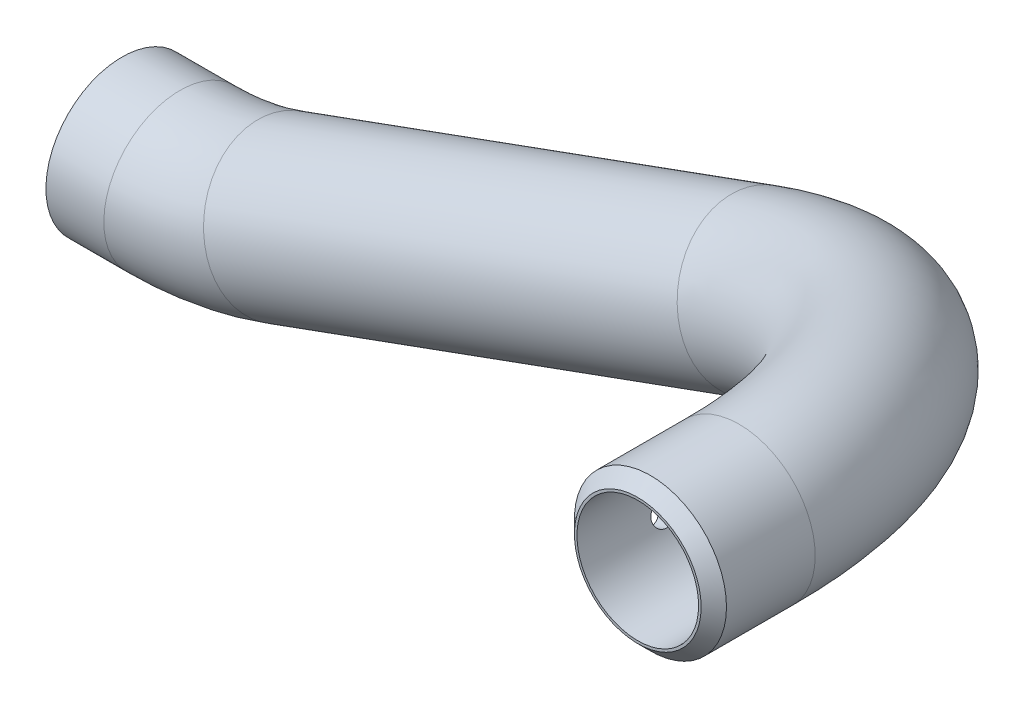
ISO-10303-21;
HEADER;
FILE_DESCRIPTION(('STEP AP214'),'2;1');
FILE_NAME('part.step','',(''),(''),'','','');
FILE_SCHEMA(('AUTOMOTIVE_DESIGN { 1 0 10303 214 1 1 1 1 }'));
ENDSEC;
DATA;
#1=APPLICATION_CONTEXT('core data for automotive mechanical design processes');
#2=APPLICATION_PROTOCOL_DEFINITION('international standard','automotive_design',2000,#1);
#3=PRODUCT_CONTEXT('',#1,'mechanical');
#4=PRODUCT('Part','Part','',(#3));
#5=PRODUCT_RELATED_PRODUCT_CATEGORY('part','',(#4));
#6=PRODUCT_DEFINITION_FORMATION('','',#4);
#7=PRODUCT_DEFINITION_CONTEXT('part definition',#1,'design');
#8=PRODUCT_DEFINITION('design','',#6,#7);
#9=PRODUCT_DEFINITION_SHAPE('','',#8);
#10=(LENGTH_UNIT() NAMED_UNIT(*) SI_UNIT(.MILLI.,.METRE.));
#11=(NAMED_UNIT(*) PLANE_ANGLE_UNIT() SI_UNIT($,.RADIAN.));
#12=(NAMED_UNIT(*) SI_UNIT($,.STERADIAN.) SOLID_ANGLE_UNIT());
#13=UNCERTAINTY_MEASURE_WITH_UNIT(LENGTH_MEASURE(1.E-05),#10,'distance_accuracy_value','');
#14=(GEOMETRIC_REPRESENTATION_CONTEXT(3) GLOBAL_UNCERTAINTY_ASSIGNED_CONTEXT((#13)) GLOBAL_UNIT_ASSIGNED_CONTEXT((#10,
#11,#12)) REPRESENTATION_CONTEXT('',''));
#15=CARTESIAN_POINT('',(0.,0.,0.));
#16=DIRECTION('',(0.,0.,1.));
#17=DIRECTION('',(1.,0.,0.));
#18=AXIS2_PLACEMENT_3D('',#15,#16,#17);
#19=CARTESIAN_POINT('',(181.747745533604,58.1434243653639,60.0000000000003));
#20=DIRECTION('',(0.,0.,1.));
#21=DIRECTION('',(1.,0.,0.));
#22=AXIS2_PLACEMENT_3D('',#19,#20,#21);
#23=CYLINDRICAL_SURFACE('',#22,15.);
#24=CARTESIAN_POINT('',(181.747745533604,58.1434243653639,60.0000000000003));
#25=DIRECTION('',(0.,0.,1.));
#26=DIRECTION('',(0.939692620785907,0.342020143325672,0.));
#27=AXIS2_PLACEMENT_3D('',#24,#25,#26);
#28=CIRCLE('',#27,15.);
#29=CARTESIAN_POINT('',(195.843134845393,63.2737265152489,60.0000000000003));
#30=VERTEX_POINT('',#29);
#31=EDGE_CURVE('E53',#30,#30,#28,.T.);
#32=ORIENTED_EDGE('',*,*,#31,.T.);
#33=EDGE_LOOP('',(#32));
#34=FACE_BOUND('',#33,.T.);
#35=CARTESIAN_POINT('',(181.747745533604,58.1434243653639,77.5));
#36=DIRECTION('',(0.,0.,1.));
#37=DIRECTION('',(1.,0.,0.));
#38=AXIS2_PLACEMENT_3D('',#35,#36,#37);
#39=CIRCLE('',#38,15.);
#40=CARTESIAN_POINT('',(196.747745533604,58.1434243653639,77.5000000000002));
#41=VERTEX_POINT('',#40);
#42=EDGE_CURVE('E10',#41,#41,#39,.F.);
#43=ORIENTED_EDGE('',*,*,#42,.T.);
#44=EDGE_LOOP('',(#43));
#45=FACE_BOUND('',#44,.T.);
#46=CARTESIAN_POINT('',(167.083470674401,54.9876292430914,64.0000000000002));
#47=CARTESIAN_POINT('',(167.083470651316,54.9876241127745,64.114571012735));
#48=CARTESIAN_POINT('',(167.085508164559,54.9781151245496,64.2292113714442));
#49=CARTESIAN_POINT('',(167.093707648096,54.9403739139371,64.4552950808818));
#50=CARTESIAN_POINT('',(167.099873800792,54.9121227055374,64.5667350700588));
#51=CARTESIAN_POINT('',(167.116453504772,54.8378636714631,64.7831123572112));
#52=CARTESIAN_POINT('',(167.126864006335,54.7918685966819,64.8880542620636));
#53=CARTESIAN_POINT('',(167.152099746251,54.6836269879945,65.0885808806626));
#54=CARTESIAN_POINT('',(167.166924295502,54.621382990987,65.1841670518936));
#55=CARTESIAN_POINT('',(167.201253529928,54.4821779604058,65.3639234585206));
#56=CARTESIAN_POINT('',(167.220785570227,54.4051314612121,65.4480222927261));
#57=CARTESIAN_POINT('',(167.264572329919,54.2389315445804,65.6017990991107));
#58=CARTESIAN_POINT('',(167.288827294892,54.1497774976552,65.6714763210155));
#59=CARTESIAN_POINT('',(167.342101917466,53.961677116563,65.7946916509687));
#60=CARTESIAN_POINT('',(167.371140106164,53.8626933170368,65.8481645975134));
#61=CARTESIAN_POINT('',(167.433616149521,53.6582135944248,65.9370357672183));
#62=CARTESIAN_POINT('',(167.46705381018,53.5527179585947,65.9724347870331));
#63=CARTESIAN_POINT('',(167.537521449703,53.3390407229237,66.0239384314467));
#64=CARTESIAN_POINT('',(167.574527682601,53.2308800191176,66.0401622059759));
#65=CARTESIAN_POINT('',(167.651418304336,53.0144140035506,66.0532244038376));
#66=CARTESIAN_POINT('',(167.691302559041,52.9061086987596,66.0500637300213));
#67=CARTESIAN_POINT('',(167.772493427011,52.6931738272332,66.0245415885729));
#68=CARTESIAN_POINT('',(167.813788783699,52.5885245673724,66.0023082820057));
#69=CARTESIAN_POINT('',(167.896653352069,52.385010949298,65.9394727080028));
#70=CARTESIAN_POINT('',(167.938222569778,52.2861467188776,65.8988700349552));
#71=CARTESIAN_POINT('',(168.020203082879,52.0964998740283,65.8003142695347));
#72=CARTESIAN_POINT('',(168.060610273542,52.00574397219,65.7423063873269));
#73=CARTESIAN_POINT('',(168.138478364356,51.8349642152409,65.6106267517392));
#74=CARTESIAN_POINT('',(168.175939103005,51.7549409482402,65.5369541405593));
#75=CARTESIAN_POINT('',(168.246566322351,51.6069919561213,65.3753202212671));
#76=CARTESIAN_POINT('',(168.279695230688,51.5391703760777,65.2872471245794));
#77=CARTESIAN_POINT('',(168.339735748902,51.4181099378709,65.0996944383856));
#78=CARTESIAN_POINT('',(168.366647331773,51.3648711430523,65.0002147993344));
#79=CARTESIAN_POINT('',(168.412928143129,51.2742725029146,64.7925668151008));
#80=CARTESIAN_POINT('',(168.432293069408,51.2369217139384,64.6843935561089));
#81=CARTESIAN_POINT('',(168.462446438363,51.1790937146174,64.4624852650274));
#82=CARTESIAN_POINT('',(168.473235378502,51.1586155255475,64.3487505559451));
#83=CARTESIAN_POINT('',(168.485606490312,51.1351545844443,64.1199289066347));
#84=CARTESIAN_POINT('',(168.487262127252,51.1320322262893,64.0048602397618));
#85=CARTESIAN_POINT('',(168.481475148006,51.1429881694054,63.7757780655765));
#86=CARTESIAN_POINT('',(168.474032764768,51.1570660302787,63.6617645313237));
#87=CARTESIAN_POINT('',(168.45049703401,51.2019681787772,63.4385044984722));
#88=CARTESIAN_POINT('',(168.434439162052,51.2327237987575,63.3292404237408));
#89=CARTESIAN_POINT('',(168.394524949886,51.3101684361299,63.118029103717));
#90=CARTESIAN_POINT('',(168.370668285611,51.3568581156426,63.0160821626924));
#91=CARTESIAN_POINT('',(168.316166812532,51.4653716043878,62.8216946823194));
#92=CARTESIAN_POINT('',(168.285480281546,51.5272886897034,62.7293179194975));
#93=CARTESIAN_POINT('',(168.218866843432,51.6645935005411,62.5573459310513));
#94=CARTESIAN_POINT('',(168.182939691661,51.7399818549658,62.477751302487));
#95=CARTESIAN_POINT('',(168.107200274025,51.9029406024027,62.3330484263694));
#96=CARTESIAN_POINT('',(168.067363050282,51.9905910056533,62.2680432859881));
#97=CARTESIAN_POINT('',(167.985718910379,52.1754416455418,62.1550802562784));
#98=CARTESIAN_POINT('',(167.943912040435,52.2726416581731,62.1071219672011));
#99=CARTESIAN_POINT('',(167.860124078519,52.4736991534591,62.0297818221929));
#100=CARTESIAN_POINT('',(167.818143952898,52.5775346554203,62.0003418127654));
#101=CARTESIAN_POINT('',(167.735393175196,52.7892769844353,61.9606851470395));
#102=CARTESIAN_POINT('',(167.694622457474,52.8971835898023,61.9504674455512));
#103=CARTESIAN_POINT('',(167.615903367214,53.1131027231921,61.9495676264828));
#104=CARTESIAN_POINT('',(167.57793471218,53.2211072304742,61.9587270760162));
#105=CARTESIAN_POINT('',(167.505438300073,53.4349810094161,61.9959842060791));
#106=CARTESIAN_POINT('',(167.470910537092,53.5408502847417,62.0240818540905));
#107=CARTESIAN_POINT('',(167.405991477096,53.7473118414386,62.0983651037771));
#108=CARTESIAN_POINT('',(167.375598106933,53.8479067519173,62.1445415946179));
#109=CARTESIAN_POINT('',(167.319312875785,54.0409310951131,62.2536552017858));
#110=CARTESIAN_POINT('',(167.293421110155,54.1333603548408,62.316592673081));
#111=CARTESIAN_POINT('',(167.246096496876,54.3080054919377,62.4580221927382));
#112=CARTESIAN_POINT('',(167.224700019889,54.3901360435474,62.5366317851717));
#113=CARTESIAN_POINT('',(167.186581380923,54.5408478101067,62.70692776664));
#114=CARTESIAN_POINT('',(167.169860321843,54.6094258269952,62.7986172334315));
#115=CARTESIAN_POINT('',(167.140888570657,54.7311415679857,62.9929629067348));
#116=CARTESIAN_POINT('',(167.128658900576,54.7842064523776,63.0956678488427));
#117=CARTESIAN_POINT('',(167.108608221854,54.8726851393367,63.308734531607));
#118=CARTESIAN_POINT('',(167.100782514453,54.908117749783,63.4190879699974));
#119=CARTESIAN_POINT('',(167.091195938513,54.9518938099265,63.6083168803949));
#120=CARTESIAN_POINT('',(167.088296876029,54.9652724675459,63.6860091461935));
#121=CARTESIAN_POINT('',(167.084434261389,54.9831419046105,63.8424566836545));
#122=CARTESIAN_POINT('',(167.083470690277,54.9876327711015,63.9212119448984));
#123=CARTESIAN_POINT('',(167.083470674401,54.9876292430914,64.0000000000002));
#124=B_SPLINE_CURVE_WITH_KNOTS('',3,(#46,#47,#48,#49,#50,#51,#52,#53,#54,#55,#56,#57,#58,#59,
#60,#61,#62,#63,#64,#65,#66,#67,#68,#69,#70,#71,#72,#73,#74,#75,#76,#77,#78,#79,#80,#81,#82,#83,
#84,#85,#86,#87,#88,#89,#90,#91,#92,#93,#94,#95,#96,#97,#98,#99,#100,#101,#102,#103,#104,#105,
#106,#107,#108,#109,#110,#111,#112,#113,#114,#115,#116,#117,#118,#119,#120,#121,#122,#123),
.UNSPECIFIED.,.T.,.F.,(4,2,2,2,2,2,2,2,2,2,2,2,2,2,2,2,2,2,2,2,2,2,2,2,2,2,2,2,2,2,2,2,2,2,2,2,
2,2,4),(0.,0.3434251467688,0.687198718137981,1.03072570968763,1.37419909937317,1.71971868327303,
2.0652562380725,2.41216539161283,2.75905925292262,3.10378608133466,3.44849685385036,
3.79090928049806,4.13332926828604,4.47683867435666,4.82036689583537,5.16670088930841,
5.51303638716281,5.85956903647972,6.20608158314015,6.54980278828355,6.89351519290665,
7.23582305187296,7.57814513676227,7.92261877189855,8.26710849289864,8.61396107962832,
8.96080553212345,9.30655526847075,9.65228620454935,9.99520127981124,10.3381157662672,
10.6808576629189,11.0236068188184,11.3690305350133,11.7145356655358,12.0616379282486,
12.4083691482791,12.6445376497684,12.8807038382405),.UNSPECIFIED.);
#125=CARTESIAN_POINT('',(167.083470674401,54.9876292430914,64.0000000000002));
#126=VERTEX_POINT('',#125);
#127=EDGE_CURVE('E75',#126,#126,#124,.T.);
#128=ORIENTED_EDGE('',*,*,#127,.T.);
#129=EDGE_LOOP('',(#128));
#130=FACE_BOUND('',#129,.T.);
#131=ADVANCED_FACE('F36',(#34,#45,#130),#23,.T.);
#132=CARTESIAN_POINT('',(181.747745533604,58.1434243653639,60.0000000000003));
#133=DIRECTION('',(0.,0.,1.));
#134=DIRECTION('',(1.,0.,0.));
#135=AXIS2_PLACEMENT_3D('',#132,#133,#134);
#136=CYLINDRICAL_SURFACE('',#135,12.);
#137=CARTESIAN_POINT('',(181.747745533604,58.1434243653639,80.));
#138=DIRECTION('',(0.,0.,1.));
#139=DIRECTION('',(1.,0.,0.));
#140=AXIS2_PLACEMENT_3D('',#137,#138,#139);
#141=CIRCLE('',#140,12.);
#142=CARTESIAN_POINT('',(193.747745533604,58.1434243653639,80.0000000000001));
#143=VERTEX_POINT('',#142);
#144=EDGE_CURVE('E70',#143,#143,#141,.T.);
#145=ORIENTED_EDGE('',*,*,#144,.T.);
#146=EDGE_LOOP('',(#145));
#147=FACE_BOUND('',#146,.T.);
#148=CARTESIAN_POINT('',(181.747745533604,58.1434243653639,60.0000000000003));
#149=DIRECTION('',(0.,0.,1.));
#150=DIRECTION('',(1.,0.,0.));
#151=AXIS2_PLACEMENT_3D('',#148,#149,#150);
#152=CIRCLE('',#151,12.);
#153=CARTESIAN_POINT('',(193.024056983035,62.2476660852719,60.0000000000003));
#154=VERTEX_POINT('',#153);
#155=EDGE_CURVE('E78',#154,#154,#152,.T.);
#156=ORIENTED_EDGE('',*,*,#155,.F.);
#157=EDGE_LOOP('',(#156));
#158=FACE_BOUND('',#157,.T.);
#159=CARTESIAN_POINT('',(169.936055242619,56.0258851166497,64.0000000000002));
#160=CARTESIAN_POINT('',(169.93605483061,56.0258801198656,64.1142443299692));
#161=CARTESIAN_POINT('',(169.937759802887,56.0163081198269,64.2285499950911));
#162=CARTESIAN_POINT('',(169.944662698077,55.978339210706,64.4539510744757));
#163=CARTESIAN_POINT('',(169.949863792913,55.9499252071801,64.5650434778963));
#164=CARTESIAN_POINT('',(169.96398359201,55.8753003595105,64.7807234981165));
#165=CARTESIAN_POINT('',(169.972899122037,55.8291047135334,64.8853165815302));
#166=CARTESIAN_POINT('',(169.994771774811,55.7204791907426,65.0852129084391));
#167=CARTESIAN_POINT('',(170.00772846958,55.6580510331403,65.1805171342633));
#168=CARTESIAN_POINT('',(170.038180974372,55.51830634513,65.3601273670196));
#169=CARTESIAN_POINT('',(170.05571773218,55.4408572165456,65.4443232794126));
#170=CARTESIAN_POINT('',(170.09558025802,55.2738600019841,65.5983700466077));
#171=CARTESIAN_POINT('',(170.117906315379,55.1843111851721,65.6682200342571));
#172=CARTESIAN_POINT('',(170.167653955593,54.9952376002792,65.7920070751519));
#173=CARTESIAN_POINT('',(170.195106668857,54.8956536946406,65.8458414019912));
#174=CARTESIAN_POINT('',(170.254901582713,54.6900218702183,65.9354083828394));
#175=CARTESIAN_POINT('',(170.287243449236,54.5839743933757,65.9711422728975));
#176=CARTESIAN_POINT('',(170.356020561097,54.3696813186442,66.0231565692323));
#177=CARTESIAN_POINT('',(170.392413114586,54.2614669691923,66.0396220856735));
#178=CARTESIAN_POINT('',(170.46871100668,54.0450664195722,66.053208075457));
#179=CARTESIAN_POINT('',(170.508616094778,53.9368802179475,66.050329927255));
#180=CARTESIAN_POINT('',(170.590311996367,53.7247747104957,66.0254541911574));
#181=CARTESIAN_POINT('',(170.632078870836,53.6208227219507,66.0036558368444));
#182=CARTESIAN_POINT('',(170.7164210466,53.4188219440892,65.9418724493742));
#183=CARTESIAN_POINT('',(170.758996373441,53.3207733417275,65.9018868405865));
#184=CARTESIAN_POINT('',(170.843491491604,53.1326420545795,65.8046675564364));
#185=CARTESIAN_POINT('',(170.885407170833,53.0425997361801,65.7473522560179));
#186=CARTESIAN_POINT('',(170.966579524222,52.8731970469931,65.6171604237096));
#187=CARTESIAN_POINT('',(171.005835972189,52.7938375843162,65.544282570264));
#188=CARTESIAN_POINT('',(171.080358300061,52.6467208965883,65.3839306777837));
#189=CARTESIAN_POINT('',(171.115566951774,52.5791244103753,65.296282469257));
#190=CARTESIAN_POINT('',(171.179634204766,52.4583817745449,65.1094634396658));
#191=CARTESIAN_POINT('',(171.208492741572,52.4052357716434,65.0102925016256));
#192=CARTESIAN_POINT('',(171.258341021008,52.3146093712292,64.803039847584));
#193=CARTESIAN_POINT('',(171.279321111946,52.2771481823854,64.6949473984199));
#194=CARTESIAN_POINT('',(171.312162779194,52.2189209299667,64.4730336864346));
#195=CARTESIAN_POINT('',(171.324025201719,52.1981533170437,64.3592129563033));
#196=CARTESIAN_POINT('',(171.337841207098,52.1739951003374,64.1306024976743));
#197=CARTESIAN_POINT('',(171.33991719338,52.170389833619,64.0158428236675));
#198=CARTESIAN_POINT('',(171.33437065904,52.1800651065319,63.7872776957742));
#199=CARTESIAN_POINT('',(171.326748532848,52.193344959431,63.6734722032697));
#200=CARTESIAN_POINT('',(171.30233699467,52.2363068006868,63.4508248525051));
#201=CARTESIAN_POINT('',(171.285609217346,52.2658785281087,63.3419548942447));
#202=CARTESIAN_POINT('',(171.243965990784,52.3406289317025,63.1313756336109));
#203=CARTESIAN_POINT('',(171.219050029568,52.3858085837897,63.0296667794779));
#204=CARTESIAN_POINT('',(171.162082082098,52.491226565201,62.8352148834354));
#205=CARTESIAN_POINT('',(171.12996342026,52.5516062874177,62.7425680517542));
#206=CARTESIAN_POINT('',(171.060368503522,52.6857992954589,62.5698662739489));
#207=CARTESIAN_POINT('',(171.022891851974,52.7596135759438,62.4898122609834));
#208=CARTESIAN_POINT('',(170.943940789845,52.9198383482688,62.3436751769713));
#209=CARTESIAN_POINT('',(170.9024270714,53.0063780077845,62.2777548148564));
#210=CARTESIAN_POINT('',(170.817652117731,53.1893143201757,62.1628975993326));
#211=CARTESIAN_POINT('',(170.774390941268,53.2857106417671,62.1139601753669));
#212=CARTESIAN_POINT('',(170.688150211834,53.485408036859,62.0347093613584));
#213=CARTESIAN_POINT('',(170.645170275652,53.5886755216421,62.0043118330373));
#214=CARTESIAN_POINT('',(170.560932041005,53.7996818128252,61.9627331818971));
#215=CARTESIAN_POINT('',(170.519673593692,53.9074202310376,61.9515503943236));
#216=CARTESIAN_POINT('',(170.44074206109,54.1228930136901,61.9487684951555));
#217=CARTESIAN_POINT('',(170.403030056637,54.2306100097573,61.9569221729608));
#218=CARTESIAN_POINT('',(170.331573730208,54.444273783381,61.9920457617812));
#219=CARTESIAN_POINT('',(170.297829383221,54.5502205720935,62.0190155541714));
#220=CARTESIAN_POINT('',(170.234945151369,54.7571117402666,62.0909091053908));
#221=CARTESIAN_POINT('',(170.205799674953,54.8580620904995,62.1358108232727));
#222=CARTESIAN_POINT('',(170.152308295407,55.0521493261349,62.2422657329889));
#223=CARTESIAN_POINT('',(170.127962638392,55.1452858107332,62.303819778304));
#224=CARTESIAN_POINT('',(170.083769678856,55.3220629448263,62.4427036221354));
#225=CARTESIAN_POINT('',(170.063979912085,55.405576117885,62.5202140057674));
#226=CARTESIAN_POINT('',(170.02903074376,55.5592513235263,62.6884319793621));
#227=CARTESIAN_POINT('',(170.013872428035,55.6294102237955,62.7791426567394));
#228=CARTESIAN_POINT('',(169.987745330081,55.7545906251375,62.9719929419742));
#229=CARTESIAN_POINT('',(169.976808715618,55.8094950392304,63.0742129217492));
#230=CARTESIAN_POINT('',(169.958926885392,55.9015562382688,63.2866024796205));
#231=CARTESIAN_POINT('',(169.95197772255,55.9387305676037,63.3967640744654));
#232=CARTESIAN_POINT('',(169.94323842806,55.9861115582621,63.5894465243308));
#233=CARTESIAN_POINT('',(169.940539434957,56.000998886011,63.6708075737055));
#234=CARTESIAN_POINT('',(169.936948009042,56.0208873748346,63.8347684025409));
#235=CARTESIAN_POINT('',(169.936055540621,56.0258887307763,63.9173681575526));
#236=CARTESIAN_POINT('',(169.936055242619,56.0258851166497,64.0000000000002));
#237=B_SPLINE_CURVE_WITH_KNOTS('',3,(#159,#160,#161,#162,#163,#164,#165,#166,#167,#168,#169,
#170,#171,#172,#173,#174,#175,#176,#177,#178,#179,#180,#181,#182,#183,#184,#185,#186,#187,#188,
#189,#190,#191,#192,#193,#194,#195,#196,#197,#198,#199,#200,#201,#202,#203,#204,#205,#206,#207,
#208,#209,#210,#211,#212,#213,#214,#215,#216,#217,#218,#219,#220,#221,#222,#223,#224,#225,#226,
#227,#228,#229,#230,#231,#232,#233,#234,#235,#236),.UNSPECIFIED.,.T.,.F.,(4,2,2,2,2,2,2,2,2,2,2,
2,2,2,2,2,2,2,2,2,2,2,2,2,2,2,2,2,2,2,2,2,2,2,2,2,2,2,4),(0.,0.342430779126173,
0.685172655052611,1.02762223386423,1.37003555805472,1.71562174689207,2.06122881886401,
2.40900709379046,2.7567616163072,3.1011471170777,3.44550807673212,3.78628624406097,
4.12707519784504,4.46949500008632,4.8119438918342,5.15875673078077,5.5055730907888,
5.85281295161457,6.20002058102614,6.54287379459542,6.88571306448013,7.2262600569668,
7.56682834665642,7.91068993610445,8.25457699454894,8.60223242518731,8.94987617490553,
9.29593026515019,9.6419543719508,9.98357856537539,10.3252006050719,10.6664040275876,
11.0076249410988,11.352943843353,11.6983436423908,12.046325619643,12.3939625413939,
12.6416443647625,12.889321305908),.UNSPECIFIED.);
#238=CARTESIAN_POINT('',(169.936055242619,56.0258851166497,64.0000000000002));
#239=VERTEX_POINT('',#238);
#240=EDGE_CURVE('E40',#239,#239,#237,.T.);
#241=ORIENTED_EDGE('',*,*,#240,.F.);
#242=EDGE_LOOP('',(#241));
#243=FACE_BOUND('',#242,.T.);
#244=ADVANCED_FACE('F103',(#147,#158,#243),#136,.F.);
#245=CARTESIAN_POINT('',(125.36618828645,37.6222157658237,60.));
#246=DIRECTION('',(0.342020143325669,-0.939692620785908,0.));
#247=DIRECTION('',(0.939692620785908,0.342020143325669,0.));
#248=AXIS2_PLACEMENT_3D('',#245,#246,#247);
#249=TOROIDAL_SURFACE('',#248,60.,15.);
#250=CARTESIAN_POINT('',(125.36618828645,37.6222157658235,0.));
#251=DIRECTION('',(0.939692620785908,0.34202014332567,0.));
#252=DIRECTION('',(0.,0.,-1.));
#253=AXIS2_PLACEMENT_3D('',#250,#251,#252);
#254=CIRCLE('',#253,15.);
#255=CARTESIAN_POINT('',(125.36618828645,37.6222157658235,-15.));
#256=VERTEX_POINT('',#255);
#257=EDGE_CURVE('E58',#256,#256,#254,.T.);
#258=CARTESIAN_POINT('',(125.36618828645,37.6222157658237,60.));
#259=DIRECTION('',(0.342020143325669,-0.939692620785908,0.));
#260=DIRECTION('',(0.939692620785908,0.342020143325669,0.));
#261=AXIS2_PLACEMENT_3D('',#258,#259,#260);
#262=CIRCLE('',#261,75.);
#263=EDGE_CURVE('',#256,#30,#262,.T.);
#264=ORIENTED_EDGE('',*,*,#257,.T.);
#265=ORIENTED_EDGE('',*,*,#31,.F.);
#266=ORIENTED_EDGE('',*,*,#263,.T.);
#267=ORIENTED_EDGE('',*,*,#263,.F.);
#268=EDGE_LOOP('',(#264,#266,#265,#267));
#269=FACE_BOUND('',#268,.T.);
#270=ADVANCED_FACE('F107',(#269),#249,.T.);
#271=CARTESIAN_POINT('',(31.9415897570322,3.61844275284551,0.));
#272=DIRECTION('',(0.939692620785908,0.342020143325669,0.));
#273=DIRECTION('',(-0.342020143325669,0.939692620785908,0.));
#274=AXIS2_PLACEMENT_3D('',#271,#272,#273);
#275=CYLINDRICAL_SURFACE('',#274,15.);
#276=CARTESIAN_POINT('',(31.9415897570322,3.61844275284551,0.));
#277=DIRECTION('',(0.939692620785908,0.34202014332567,0.));
#278=DIRECTION('',(0.,0.,-1.));
#279=AXIS2_PLACEMENT_3D('',#276,#277,#278);
#280=CIRCLE('',#279,15.);
#281=CARTESIAN_POINT('',(37.0718919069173,-10.4769465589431,0.));
#282=VERTEX_POINT('',#281);
#283=EDGE_CURVE('E61',#282,#282,#280,.T.);
#284=ORIENTED_EDGE('',*,*,#283,.T.);
#285=EDGE_LOOP('',(#284));
#286=FACE_BOUND('',#285,.T.);
#287=ORIENTED_EDGE('',*,*,#257,.F.);
#288=EDGE_LOOP('',(#287));
#289=FACE_BOUND('',#288,.T.);
#290=ADVANCED_FACE('F139',(#286,#289),#275,.T.);
#291=CARTESIAN_POINT('',(11.4203811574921,60.,0.));
#292=DIRECTION('',(0.,0.,1.));
#293=DIRECTION('',(0.,-1.,0.));
#294=AXIS2_PLACEMENT_3D('',#291,#292,#293);
#295=TOROIDAL_SURFACE('',#294,60.,15.);
#296=CARTESIAN_POINT('',(11.4203811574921,0.,0.));
#297=DIRECTION('',(1.,0.,0.));
#298=DIRECTION('',(0.,0.,-1.));
#299=AXIS2_PLACEMENT_3D('',#296,#297,#298);
#300=CIRCLE('',#299,15.);
#301=CARTESIAN_POINT('',(11.4203811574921,-15.,0.));
#302=VERTEX_POINT('',#301);
#303=EDGE_CURVE('E64',#302,#302,#300,.T.);
#304=CARTESIAN_POINT('',(11.4203811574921,60.,0.));
#305=DIRECTION('',(0.,0.,1.));
#306=DIRECTION('',(0.,-1.,0.));
#307=AXIS2_PLACEMENT_3D('',#304,#305,#306);
#308=CIRCLE('',#307,75.);
#309=EDGE_CURVE('',#302,#282,#308,.T.);
#310=ORIENTED_EDGE('',*,*,#303,.T.);
#311=ORIENTED_EDGE('',*,*,#283,.F.);
#312=ORIENTED_EDGE('',*,*,#309,.T.);
#313=ORIENTED_EDGE('',*,*,#309,.F.);
#314=EDGE_LOOP('',(#310,#312,#311,#313));
#315=FACE_BOUND('',#314,.T.);
#316=ADVANCED_FACE('F135',(#315),#295,.T.);
#317=CARTESIAN_POINT('',(11.4203811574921,0.,0.));
#318=DIRECTION('',(-1.,0.,0.));
#319=DIRECTION('',(0.,0.,1.));
#320=AXIS2_PLACEMENT_3D('',#317,#318,#319);
#321=CYLINDRICAL_SURFACE('',#320,15.);
#322=ORIENTED_EDGE('',*,*,#303,.F.);
#323=EDGE_LOOP('',(#322));
#324=FACE_BOUND('',#323,.T.);
#325=CARTESIAN_POINT('',(0.,0.,0.));
#326=DIRECTION('',(1.,0.,0.));
#327=DIRECTION('',(0.,0.,-1.));
#328=AXIS2_PLACEMENT_3D('',#325,#326,#327);
#329=CIRCLE('',#328,15.);
#330=CARTESIAN_POINT('',(0.,0.,-15.));
#331=VERTEX_POINT('',#330);
#332=EDGE_CURVE('E67',#331,#331,#329,.T.);
#333=ORIENTED_EDGE('',*,*,#332,.T.);
#334=EDGE_LOOP('',(#333));
#335=FACE_BOUND('',#334,.T.);
#336=ADVANCED_FACE('F131',(#324,#335),#321,.T.);
#337=CARTESIAN_POINT('',(181.747745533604,58.1434243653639,80.));
#338=DIRECTION('',(0.,0.,1.));
#339=DIRECTION('',(0.939692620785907,0.342020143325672,0.));
#340=AXIS2_PLACEMENT_3D('',#337,#338,#339);
#341=PLANE('',#340);
#342=CARTESIAN_POINT('',(181.747745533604,58.1434243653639,80.));
#343=DIRECTION('',(0.,0.,1.));
#344=DIRECTION('',(1.,0.,0.));
#345=AXIS2_PLACEMENT_3D('',#342,#343,#344);
#346=CIRCLE('',#345,12.5);
#347=CARTESIAN_POINT('',(194.247745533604,58.1434243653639,80.0000000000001));
#348=VERTEX_POINT('',#347);
#349=EDGE_CURVE('E49',#348,#348,#346,.T.);
#350=ORIENTED_EDGE('',*,*,#349,.T.);
#351=EDGE_LOOP('',(#350));
#352=FACE_BOUND('',#351,.T.);
#353=ORIENTED_EDGE('',*,*,#144,.F.);
#354=EDGE_LOOP('',(#353));
#355=FACE_BOUND('',#354,.T.);
#356=ADVANCED_FACE('F127',(#352,#355),#341,.T.);
#357=CARTESIAN_POINT('',(0.,0.,0.));
#358=DIRECTION('',(1.,0.,0.));
#359=DIRECTION('',(0.,0.,-1.));
#360=AXIS2_PLACEMENT_3D('',#357,#358,#359);
#361=PLANE('',#360);
#362=CARTESIAN_POINT('',(0.,0.,0.));
#363=DIRECTION('',(1.,0.,0.));
#364=DIRECTION('',(0.,0.,-1.));
#365=AXIS2_PLACEMENT_3D('',#362,#363,#364);
#366=CIRCLE('',#365,12.);
#367=CARTESIAN_POINT('',(0.,0.,-12.));
#368=VERTEX_POINT('',#367);
#369=EDGE_CURVE('E71',#368,#368,#366,.T.);
#370=ORIENTED_EDGE('',*,*,#369,.T.);
#371=EDGE_LOOP('',(#370));
#372=FACE_BOUND('',#371,.T.);
#373=ORIENTED_EDGE('',*,*,#332,.F.);
#374=EDGE_LOOP('',(#373));
#375=FACE_BOUND('',#374,.T.);
#376=ADVANCED_FACE('F113',(#372,#375),#361,.F.);
#377=CARTESIAN_POINT('',(125.36618828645,37.6222157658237,60.));
#378=DIRECTION('',(0.342020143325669,-0.939692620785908,0.));
#379=DIRECTION('',(0.939692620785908,0.342020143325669,0.));
#380=AXIS2_PLACEMENT_3D('',#377,#378,#379);
#381=TOROIDAL_SURFACE('',#380,60.,12.);
#382=CARTESIAN_POINT('',(125.36618828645,37.6222157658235,0.));
#383=DIRECTION('',(-0.939692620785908,-0.342020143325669,0.));
#384=DIRECTION('',(0.342020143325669,-0.939692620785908,0.));
#385=AXIS2_PLACEMENT_3D('',#382,#383,#384);
#386=CIRCLE('',#385,12.);
#387=CARTESIAN_POINT('',(125.36618828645,37.6222157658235,-12.));
#388=VERTEX_POINT('',#387);
#389=EDGE_CURVE('E84',#388,#388,#386,.F.);
#390=CARTESIAN_POINT('',(125.36618828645,37.6222157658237,60.));
#391=DIRECTION('',(0.342020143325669,-0.939692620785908,0.));
#392=DIRECTION('',(0.939692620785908,0.342020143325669,0.));
#393=AXIS2_PLACEMENT_3D('',#390,#391,#392);
#394=CIRCLE('',#393,72.);
#395=EDGE_CURVE('',#388,#154,#394,.T.);
#396=ORIENTED_EDGE('',*,*,#389,.F.);
#397=ORIENTED_EDGE('',*,*,#155,.T.);
#398=ORIENTED_EDGE('',*,*,#395,.T.);
#399=ORIENTED_EDGE('',*,*,#395,.F.);
#400=EDGE_LOOP('',(#396,#398,#397,#399));
#401=FACE_BOUND('',#400,.T.);
#402=ADVANCED_FACE('F109',(#401),#381,.F.);
#403=CARTESIAN_POINT('',(31.9415897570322,3.61844275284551,0.));
#404=DIRECTION('',(0.939692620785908,0.342020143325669,0.));
#405=DIRECTION('',(-0.342020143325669,0.939692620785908,0.));
#406=AXIS2_PLACEMENT_3D('',#403,#404,#405);
#407=CYLINDRICAL_SURFACE('',#406,12.);
#408=CARTESIAN_POINT('',(31.9415897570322,3.61844275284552,0.));
#409=DIRECTION('',(0.939692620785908,0.342020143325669,0.));
#410=DIRECTION('',(-0.342020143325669,0.939692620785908,0.));
#411=AXIS2_PLACEMENT_3D('',#408,#409,#410);
#412=CIRCLE('',#411,12.);
#413=CARTESIAN_POINT('',(36.0458314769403,-7.65786869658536,0.));
#414=VERTEX_POINT('',#413);
#415=EDGE_CURVE('E81',#414,#414,#412,.T.);
#416=ORIENTED_EDGE('',*,*,#415,.F.);
#417=EDGE_LOOP('',(#416));
#418=FACE_BOUND('',#417,.T.);
#419=ORIENTED_EDGE('',*,*,#389,.T.);
#420=EDGE_LOOP('',(#419));
#421=FACE_BOUND('',#420,.T.);
#422=ADVANCED_FACE('F112',(#418,#421),#407,.F.);
#423=CARTESIAN_POINT('',(11.4203811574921,60.,0.));
#424=DIRECTION('',(0.,0.,1.));
#425=DIRECTION('',(0.,-1.,0.));
#426=AXIS2_PLACEMENT_3D('',#423,#424,#425);
#427=TOROIDAL_SURFACE('',#426,60.,12.);
#428=CARTESIAN_POINT('',(11.4203811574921,0.,0.));
#429=DIRECTION('',(-1.,0.,0.));
#430=DIRECTION('',(0.,0.,1.));
#431=AXIS2_PLACEMENT_3D('',#428,#429,#430);
#432=CIRCLE('',#431,12.);
#433=CARTESIAN_POINT('',(11.4203811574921,-12.,0.));
#434=VERTEX_POINT('',#433);
#435=EDGE_CURVE('E74',#434,#434,#432,.F.);
#436=CARTESIAN_POINT('',(11.4203811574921,60.,0.));
#437=DIRECTION('',(0.,0.,1.));
#438=DIRECTION('',(0.,-1.,0.));
#439=AXIS2_PLACEMENT_3D('',#436,#437,#438);
#440=CIRCLE('',#439,72.);
#441=EDGE_CURVE('',#434,#414,#440,.T.);
#442=ORIENTED_EDGE('',*,*,#435,.F.);
#443=ORIENTED_EDGE('',*,*,#415,.T.);
#444=ORIENTED_EDGE('',*,*,#441,.T.);
#445=ORIENTED_EDGE('',*,*,#441,.F.);
#446=EDGE_LOOP('',(#442,#444,#443,#445));
#447=FACE_BOUND('',#446,.T.);
#448=ADVANCED_FACE('F117',(#447),#427,.F.);
#449=CARTESIAN_POINT('',(11.4203811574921,0.,0.));
#450=DIRECTION('',(-1.,0.,0.));
#451=DIRECTION('',(0.,0.,1.));
#452=AXIS2_PLACEMENT_3D('',#449,#450,#451);
#453=CYLINDRICAL_SURFACE('',#452,12.);
#454=ORIENTED_EDGE('',*,*,#435,.T.);
#455=EDGE_LOOP('',(#454));
#456=FACE_BOUND('',#455,.T.);
#457=ORIENTED_EDGE('',*,*,#369,.F.);
#458=EDGE_LOOP('',(#457));
#459=FACE_BOUND('',#458,.T.);
#460=ADVANCED_FACE('F101',(#456,#459),#453,.F.);
#461=CARTESIAN_POINT('',(181.747745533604,58.1434243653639,80.));
#462=DIRECTION('',(0.,0.,-1.));
#463=DIRECTION('',(-1.,0.,0.));
#464=AXIS2_PLACEMENT_3D('',#461,#462,#463);
#465=CONICAL_SURFACE('',#464,12.5,0.785398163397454);
#466=ORIENTED_EDGE('',*,*,#42,.F.);
#467=EDGE_LOOP('',(#466));
#468=FACE_BOUND('',#467,.T.);
#469=ORIENTED_EDGE('',*,*,#349,.F.);
#470=EDGE_LOOP('',(#469));
#471=FACE_BOUND('',#470,.T.);
#472=ADVANCED_FACE('F97',(#468,#471),#465,.T.);
#473=CARTESIAN_POINT('',(-2.24739594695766,-8.82533038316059,64.000000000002));
#474=DIRECTION('',(0.939692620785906,0.342020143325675,0.));
#475=DIRECTION('',(-0.342020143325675,0.939692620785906,0.));
#476=AXIS2_PLACEMENT_3D('',#473,#474,#475);
#477=CYLINDRICAL_SURFACE('',#476,2.04999999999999);
#478=ORIENTED_EDGE('',*,*,#127,.F.);
#479=EDGE_LOOP('',(#478));
#480=FACE_BOUND('',#479,.T.);
#481=ORIENTED_EDGE('',*,*,#240,.T.);
#482=EDGE_LOOP('',(#481));
#483=FACE_BOUND('',#482,.T.);
#484=ADVANCED_FACE('F93',(#480,#483),#477,.F.);
#485=CLOSED_SHELL('',(#131,#244,#270,#290,#316,#336,#356,#376,#402,#422,#448,#460,#472,#484));
#486=MANIFOLD_SOLID_BREP('B2',#485);
#487=ADVANCED_BREP_SHAPE_REPRESENTATION('',(#18,#486),#14);
#488=SHAPE_DEFINITION_REPRESENTATION(#9,#487);
ENDSEC;
END-ISO-10303-21;
